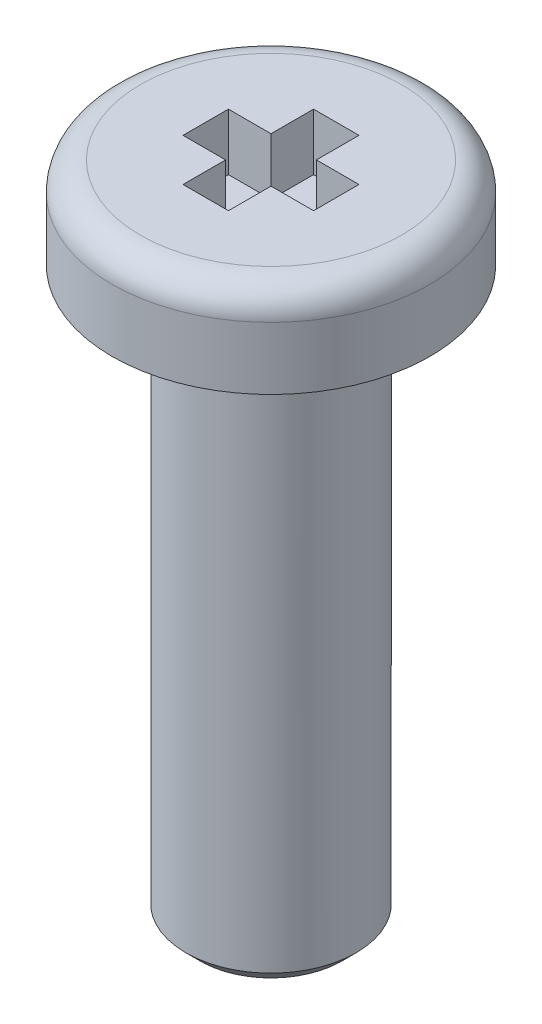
ISO-10303-21;
HEADER;
FILE_DESCRIPTION(('STEP AP214'),'2;1');
FILE_NAME('part.step','',(''),(''),'','','');
FILE_SCHEMA(('AUTOMOTIVE_DESIGN { 1 0 10303 214 1 1 1 1 }'));
ENDSEC;
DATA;
#1=APPLICATION_CONTEXT('core data for automotive mechanical design processes');
#2=APPLICATION_PROTOCOL_DEFINITION('international standard','automotive_design',2000,#1);
#3=PRODUCT_CONTEXT('',#1,'mechanical');
#4=PRODUCT('Part','Part','',(#3));
#5=PRODUCT_RELATED_PRODUCT_CATEGORY('part','',(#4));
#6=PRODUCT_DEFINITION_FORMATION('','',#4);
#7=PRODUCT_DEFINITION_CONTEXT('part definition',#1,'design');
#8=PRODUCT_DEFINITION('design','',#6,#7);
#9=PRODUCT_DEFINITION_SHAPE('','',#8);
#10=(LENGTH_UNIT() NAMED_UNIT(*) SI_UNIT(.MILLI.,.METRE.));
#11=(NAMED_UNIT(*) PLANE_ANGLE_UNIT() SI_UNIT($,.RADIAN.));
#12=(NAMED_UNIT(*) SI_UNIT($,.STERADIAN.) SOLID_ANGLE_UNIT());
#13=UNCERTAINTY_MEASURE_WITH_UNIT(LENGTH_MEASURE(1.E-05),#10,'distance_accuracy_value','');
#14=(GEOMETRIC_REPRESENTATION_CONTEXT(3) GLOBAL_UNCERTAINTY_ASSIGNED_CONTEXT((#13)) GLOBAL_UNIT_ASSIGNED_CONTEXT((#10,
#11,#12)) REPRESENTATION_CONTEXT('',''));
#15=CARTESIAN_POINT('',(0.,0.,0.));
#16=DIRECTION('',(0.,0.,1.));
#17=DIRECTION('',(1.,0.,0.));
#18=AXIS2_PLACEMENT_3D('',#15,#16,#17);
#19=CARTESIAN_POINT('',(2.8,0.,0.));
#20=DIRECTION('',(0.,1.,0.));
#21=DIRECTION('',(0.,0.,1.));
#22=AXIS2_PLACEMENT_3D('',#19,#20,#21);
#23=PLANE('',#22);
#24=CARTESIAN_POINT('',(0.,0.,0.));
#25=DIRECTION('',(0.,1.,0.));
#26=DIRECTION('',(0.,0.,1.));
#27=AXIS2_PLACEMENT_3D('',#24,#25,#26);
#28=CIRCLE('',#27,1.7);
#29=CARTESIAN_POINT('',(0.,0.,1.7));
#30=VERTEX_POINT('',#29);
#31=EDGE_CURVE('E209',#30,#30,#28,.T.);
#32=ORIENTED_EDGE('',*,*,#31,.T.);
#33=EDGE_LOOP('',(#32));
#34=FACE_BOUND('',#33,.T.);
#35=CARTESIAN_POINT('',(0.,0.,0.));
#36=DIRECTION('',(0.,1.,0.));
#37=DIRECTION('',(0.,0.,1.));
#38=AXIS2_PLACEMENT_3D('',#35,#36,#37);
#39=CIRCLE('',#38,2.8);
#40=CARTESIAN_POINT('',(0.,0.,2.8));
#41=VERTEX_POINT('',#40);
#42=EDGE_CURVE('E203',#41,#41,#39,.T.);
#43=ORIENTED_EDGE('',*,*,#42,.F.);
#44=EDGE_LOOP('',(#43));
#45=FACE_BOUND('',#44,.T.);
#46=ADVANCED_FACE('F31',(#34,#45),#23,.F.);
#47=CARTESIAN_POINT('',(0.4,0.6,1.15));
#48=DIRECTION('',(1.,0.,0.));
#49=DIRECTION('',(0.,0.,-1.));
#50=AXIS2_PLACEMENT_3D('',#47,#48,#49);
#51=PLANE('',#50);
#52=DIRECTION('',(0.,1.,0.));
#53=VECTOR('',#52,1.);
#54=CARTESIAN_POINT('',(0.4,0.6,0.399999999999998));
#55=LINE('',#54,#53);
#56=CARTESIAN_POINT('',(0.4,0.6,0.399999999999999));
#57=VERTEX_POINT('',#56);
#58=CARTESIAN_POINT('',(0.4,1.6,0.399999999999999));
#59=VERTEX_POINT('',#58);
#60=EDGE_CURVE('E153',#57,#59,#55,.T.);
#61=ORIENTED_EDGE('',*,*,#60,.F.);
#62=DIRECTION('',(0.,0.,-1.));
#63=VECTOR('',#62,1.);
#64=CARTESIAN_POINT('',(0.4,0.6,1.15));
#65=LINE('',#64,#63);
#66=CARTESIAN_POINT('',(0.4,0.6,1.15));
#67=VERTEX_POINT('',#66);
#68=EDGE_CURVE('E162',#67,#57,#65,.T.);
#69=ORIENTED_EDGE('',*,*,#68,.F.);
#70=DIRECTION('',(0.,1.,0.));
#71=VECTOR('',#70,1.);
#72=CARTESIAN_POINT('',(0.4,0.6,1.15));
#73=LINE('',#72,#71);
#74=CARTESIAN_POINT('',(0.4,1.6,1.15));
#75=VERTEX_POINT('',#74);
#76=EDGE_CURVE('E188',#67,#75,#73,.T.);
#77=ORIENTED_EDGE('',*,*,#76,.T.);
#78=DIRECTION('',(0.,0.,-1.));
#79=VECTOR('',#78,1.);
#80=CARTESIAN_POINT('',(0.4,1.6,1.15));
#81=LINE('',#80,#79);
#82=EDGE_CURVE('E175',#75,#59,#81,.T.);
#83=ORIENTED_EDGE('',*,*,#82,.T.);
#84=EDGE_LOOP('',(#61,#69,#77,#83));
#85=FACE_BOUND('',#84,.T.);
#86=ADVANCED_FACE('F225',(#85),#51,.F.);
#87=CARTESIAN_POINT('',(-0.4,0.6,1.15));
#88=DIRECTION('',(1.,0.,0.));
#89=DIRECTION('',(0.,0.,-1.));
#90=AXIS2_PLACEMENT_3D('',#87,#88,#89);
#91=PLANE('',#90);
#92=DIRECTION('',(0.,0.,-1.));
#93=VECTOR('',#92,1.);
#94=CARTESIAN_POINT('',(-0.4,0.6,1.15));
#95=LINE('',#94,#93);
#96=CARTESIAN_POINT('',(-0.4,0.6,1.15));
#97=VERTEX_POINT('',#96);
#98=CARTESIAN_POINT('',(-0.4,0.6,0.4));
#99=VERTEX_POINT('',#98);
#100=EDGE_CURVE('E169',#97,#99,#95,.T.);
#101=ORIENTED_EDGE('',*,*,#100,.T.);
#102=DIRECTION('',(0.,1.,0.));
#103=VECTOR('',#102,1.);
#104=CARTESIAN_POINT('',(-0.4,0.6,0.400000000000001));
#105=LINE('',#104,#103);
#106=CARTESIAN_POINT('',(-0.4,1.6,0.400000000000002));
#107=VERTEX_POINT('',#106);
#108=EDGE_CURVE('E150',#99,#107,#105,.T.);
#109=ORIENTED_EDGE('',*,*,#108,.T.);
#110=DIRECTION('',(0.,0.,-1.));
#111=VECTOR('',#110,1.);
#112=CARTESIAN_POINT('',(-0.4,1.6,1.15));
#113=LINE('',#112,#111);
#114=CARTESIAN_POINT('',(-0.4,1.6,1.15));
#115=VERTEX_POINT('',#114);
#116=EDGE_CURVE('E182',#115,#107,#113,.T.);
#117=ORIENTED_EDGE('',*,*,#116,.F.);
#118=DIRECTION('',(0.,1.,0.));
#119=VECTOR('',#118,1.);
#120=CARTESIAN_POINT('',(-0.4,0.6,1.15));
#121=LINE('',#120,#119);
#122=EDGE_CURVE('E191',#97,#115,#121,.T.);
#123=ORIENTED_EDGE('',*,*,#122,.F.);
#124=EDGE_LOOP('',(#101,#109,#117,#123));
#125=FACE_BOUND('',#124,.T.);
#126=ADVANCED_FACE('F231',(#125),#91,.T.);
#127=CARTESIAN_POINT('',(0.,11.592517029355,0.));
#128=DIRECTION('',(0.,1.,0.));
#129=DIRECTION('',(0.,0.,1.));
#130=AXIS2_PLACEMENT_3D('',#127,#128,#129);
#131=CYLINDRICAL_SURFACE('',#130,2.8);
#132=CARTESIAN_POINT('',(0.,1.1,0.));
#133=DIRECTION('',(0.,1.,0.));
#134=DIRECTION('',(0.,0.,1.));
#135=AXIS2_PLACEMENT_3D('',#132,#133,#134);
#136=CIRCLE('',#135,2.8);
#137=CARTESIAN_POINT('',(0.,1.1,2.8));
#138=VERTEX_POINT('',#137);
#139=EDGE_CURVE('E200',#138,#138,#136,.T.);
#140=ORIENTED_EDGE('',*,*,#139,.F.);
#141=EDGE_LOOP('',(#140));
#142=FACE_BOUND('',#141,.T.);
#143=ORIENTED_EDGE('',*,*,#42,.T.);
#144=EDGE_LOOP('',(#143));
#145=FACE_BOUND('',#144,.T.);
#146=ADVANCED_FACE('F237',(#142,#145),#131,.T.);
#147=CARTESIAN_POINT('',(0.,1.1,0.));
#148=DIRECTION('',(0.,1.,0.));
#149=DIRECTION('',(0.,0.,1.));
#150=AXIS2_PLACEMENT_3D('',#147,#148,#149);
#151=TOROIDAL_SURFACE('',#150,2.3,0.5);
#152=CARTESIAN_POINT('',(0.,1.6,0.));
#153=DIRECTION('',(0.,1.,0.));
#154=DIRECTION('',(0.,0.,1.));
#155=AXIS2_PLACEMENT_3D('',#152,#153,#154);
#156=CIRCLE('',#155,2.3);
#157=CARTESIAN_POINT('',(0.,1.6,2.3));
#158=VERTEX_POINT('',#157);
#159=EDGE_CURVE('E190',#158,#158,#156,.T.);
#160=ORIENTED_EDGE('',*,*,#159,.F.);
#161=EDGE_LOOP('',(#160));
#162=FACE_BOUND('',#161,.T.);
#163=ORIENTED_EDGE('',*,*,#139,.T.);
#164=EDGE_LOOP('',(#163));
#165=FACE_BOUND('',#164,.T.);
#166=ADVANCED_FACE('F240',(#162,#165),#151,.T.);
#167=CARTESIAN_POINT('',(0.,1.6,0.));
#168=DIRECTION('',(0.,-1.,0.));
#169=DIRECTION('',(0.,0.,-1.));
#170=AXIS2_PLACEMENT_3D('',#167,#168,#169);
#171=PLANE('',#170);
#172=CARTESIAN_POINT('',(0.4,1.6,-0.400000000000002));
#173=VERTEX_POINT('',#172);
#174=CARTESIAN_POINT('',(0.4,1.6,-1.15));
#175=VERTEX_POINT('',#174);
#176=EDGE_CURVE('E161',#173,#175,#81,.T.);
#177=ORIENTED_EDGE('',*,*,#176,.F.);
#178=DIRECTION('',(-1.,0.,0.));
#179=VECTOR('',#178,1.);
#180=CARTESIAN_POINT('',(1.15,1.6,-0.400000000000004));
#181=LINE('',#180,#179);
#182=CARTESIAN_POINT('',(1.15,1.6,-0.400000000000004));
#183=VERTEX_POINT('',#182);
#184=EDGE_CURVE('E438',#183,#173,#181,.T.);
#185=ORIENTED_EDGE('',*,*,#184,.F.);
#186=DIRECTION('',(0.,0.,1.));
#187=VECTOR('',#186,1.);
#188=CARTESIAN_POINT('',(1.15,1.6,-0.400000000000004));
#189=LINE('',#188,#187);
#190=CARTESIAN_POINT('',(1.15,1.6,0.399999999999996));
#191=VERTEX_POINT('',#190);
#192=EDGE_CURVE('E128',#183,#191,#189,.T.);
#193=ORIENTED_EDGE('',*,*,#192,.T.);
#194=DIRECTION('',(-1.,0.,0.));
#195=VECTOR('',#194,1.);
#196=CARTESIAN_POINT('',(1.15,1.6,0.399999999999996));
#197=LINE('',#196,#195);
#198=EDGE_CURVE('E423',#191,#59,#197,.T.);
#199=ORIENTED_EDGE('',*,*,#198,.T.);
#200=ORIENTED_EDGE('',*,*,#82,.F.);
#201=DIRECTION('',(-1.,0.,0.));
#202=VECTOR('',#201,1.);
#203=CARTESIAN_POINT('',(0.4,1.6,1.15));
#204=LINE('',#203,#202);
#205=EDGE_CURVE('E185',#75,#115,#204,.T.);
#206=ORIENTED_EDGE('',*,*,#205,.T.);
#207=ORIENTED_EDGE('',*,*,#116,.T.);
#208=CARTESIAN_POINT('',(-1.15,1.6,0.400000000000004));
#209=VERTEX_POINT('',#208);
#210=EDGE_CURVE('E429',#107,#209,#197,.T.);
#211=ORIENTED_EDGE('',*,*,#210,.T.);
#212=DIRECTION('',(0.,0.,-1.));
#213=VECTOR('',#212,1.);
#214=CARTESIAN_POINT('',(-1.15,1.6,0.400000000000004));
#215=LINE('',#214,#213);
#216=CARTESIAN_POINT('',(-1.15,1.6,-0.399999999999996));
#217=VERTEX_POINT('',#216);
#218=EDGE_CURVE('E433',#209,#217,#215,.T.);
#219=ORIENTED_EDGE('',*,*,#218,.T.);
#220=CARTESIAN_POINT('',(-0.4,1.6,-0.399999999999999));
#221=VERTEX_POINT('',#220);
#222=EDGE_CURVE('E141',#221,#217,#181,.T.);
#223=ORIENTED_EDGE('',*,*,#222,.F.);
#224=CARTESIAN_POINT('',(-0.4,1.6,-1.15));
#225=VERTEX_POINT('',#224);
#226=EDGE_CURVE('E181',#221,#225,#113,.T.);
#227=ORIENTED_EDGE('',*,*,#226,.T.);
#228=DIRECTION('',(1.,0.,0.));
#229=VECTOR('',#228,1.);
#230=CARTESIAN_POINT('',(-0.4,1.6,-1.15));
#231=LINE('',#230,#229);
#232=EDGE_CURVE('E178',#225,#175,#231,.T.);
#233=ORIENTED_EDGE('',*,*,#232,.T.);
#234=EDGE_LOOP('',(#177,#185,#193,#199,#200,#206,#207,#211,#219,#223,#227,#233));
#235=FACE_BOUND('',#234,.T.);
#236=ORIENTED_EDGE('',*,*,#159,.T.);
#237=EDGE_LOOP('',(#236));
#238=FACE_BOUND('',#237,.T.);
#239=ADVANCED_FACE('F244',(#235,#238),#171,.F.);
#240=CARTESIAN_POINT('',(0.4,0.6,-0.4));
#241=VERTEX_POINT('',#240);
#242=CARTESIAN_POINT('',(0.4,0.6,-1.15));
#243=VERTEX_POINT('',#242);
#244=EDGE_CURVE('E166',#241,#243,#65,.T.);
#245=ORIENTED_EDGE('',*,*,#244,.F.);
#246=DIRECTION('',(0.,1.,0.));
#247=VECTOR('',#246,1.);
#248=CARTESIAN_POINT('',(0.4,0.6,-0.400000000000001));
#249=LINE('',#248,#247);
#250=EDGE_CURVE('E158',#241,#173,#249,.T.);
#251=ORIENTED_EDGE('',*,*,#250,.T.);
#252=ORIENTED_EDGE('',*,*,#176,.T.);
#253=DIRECTION('',(0.,1.,0.));
#254=VECTOR('',#253,1.);
#255=CARTESIAN_POINT('',(0.4,0.6,-1.15));
#256=LINE('',#255,#254);
#257=EDGE_CURVE('E174',#243,#175,#256,.T.);
#258=ORIENTED_EDGE('',*,*,#257,.F.);
#259=EDGE_LOOP('',(#245,#251,#252,#258));
#260=FACE_BOUND('',#259,.T.);
#261=ADVANCED_FACE('F234',(#260),#51,.F.);
#262=CARTESIAN_POINT('',(0.4,0.6,1.15));
#263=DIRECTION('',(0.,0.,-1.));
#264=DIRECTION('',(-1.,0.,0.));
#265=AXIS2_PLACEMENT_3D('',#262,#263,#264);
#266=PLANE('',#265);
#267=ORIENTED_EDGE('',*,*,#205,.F.);
#268=ORIENTED_EDGE('',*,*,#76,.F.);
#269=DIRECTION('',(-1.,0.,0.));
#270=VECTOR('',#269,1.);
#271=CARTESIAN_POINT('',(0.4,0.6,1.15));
#272=LINE('',#271,#270);
#273=EDGE_CURVE('E172',#67,#97,#272,.T.);
#274=ORIENTED_EDGE('',*,*,#273,.T.);
#275=ORIENTED_EDGE('',*,*,#122,.T.);
#276=EDGE_LOOP('',(#267,#268,#274,#275));
#277=FACE_BOUND('',#276,.T.);
#278=ADVANCED_FACE('F250',(#277),#266,.T.);
#279=DIRECTION('',(0.,1.,0.));
#280=VECTOR('',#279,1.);
#281=CARTESIAN_POINT('',(-0.4,0.6,-0.399999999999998));
#282=LINE('',#281,#280);
#283=CARTESIAN_POINT('',(-0.4,0.6,-0.399999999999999));
#284=VERTEX_POINT('',#283);
#285=EDGE_CURVE('E156',#284,#221,#282,.T.);
#286=ORIENTED_EDGE('',*,*,#285,.F.);
#287=CARTESIAN_POINT('',(-0.4,0.6,-1.15));
#288=VERTEX_POINT('',#287);
#289=EDGE_CURVE('E124',#284,#288,#95,.T.);
#290=ORIENTED_EDGE('',*,*,#289,.T.);
#291=DIRECTION('',(0.,1.,0.));
#292=VECTOR('',#291,1.);
#293=CARTESIAN_POINT('',(-0.4,0.6,-1.15));
#294=LINE('',#293,#292);
#295=EDGE_CURVE('E193',#288,#225,#294,.T.);
#296=ORIENTED_EDGE('',*,*,#295,.T.);
#297=ORIENTED_EDGE('',*,*,#226,.F.);
#298=EDGE_LOOP('',(#286,#290,#296,#297));
#299=FACE_BOUND('',#298,.T.);
#300=ADVANCED_FACE('F255',(#299),#91,.T.);
#301=CARTESIAN_POINT('',(-0.4,0.6,-1.15));
#302=DIRECTION('',(0.,0.,1.));
#303=DIRECTION('',(1.,0.,0.));
#304=AXIS2_PLACEMENT_3D('',#301,#302,#303);
#305=PLANE('',#304);
#306=ORIENTED_EDGE('',*,*,#232,.F.);
#307=ORIENTED_EDGE('',*,*,#295,.F.);
#308=DIRECTION('',(1.,0.,0.));
#309=VECTOR('',#308,1.);
#310=CARTESIAN_POINT('',(-0.4,0.6,-1.15));
#311=LINE('',#310,#309);
#312=EDGE_CURVE('E165',#288,#243,#311,.T.);
#313=ORIENTED_EDGE('',*,*,#312,.T.);
#314=ORIENTED_EDGE('',*,*,#257,.T.);
#315=EDGE_LOOP('',(#306,#307,#313,#314));
#316=FACE_BOUND('',#315,.T.);
#317=ADVANCED_FACE('F252',(#316),#305,.T.);
#318=CARTESIAN_POINT('',(0.4,0.6,-1.15));
#319=DIRECTION('',(0.,-1.,0.));
#320=DIRECTION('',(0.,0.,-1.));
#321=AXIS2_PLACEMENT_3D('',#318,#319,#320);
#322=PLANE('',#321);
#323=ORIENTED_EDGE('',*,*,#289,.F.);
#324=DIRECTION('',(-1.,0.,0.));
#325=VECTOR('',#324,1.);
#326=CARTESIAN_POINT('',(1.15,0.6,-0.400000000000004));
#327=LINE('',#326,#325);
#328=CARTESIAN_POINT('',(-1.15,0.6,-0.399999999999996));
#329=VERTEX_POINT('',#328);
#330=EDGE_CURVE('E119',#284,#329,#327,.T.);
#331=ORIENTED_EDGE('',*,*,#330,.T.);
#332=DIRECTION('',(0.,0.,-1.));
#333=VECTOR('',#332,1.);
#334=CARTESIAN_POINT('',(-1.15,0.6,0.400000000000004));
#335=LINE('',#334,#333);
#336=CARTESIAN_POINT('',(-1.15,0.6,0.400000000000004));
#337=VERTEX_POINT('',#336);
#338=EDGE_CURVE('E122',#337,#329,#335,.T.);
#339=ORIENTED_EDGE('',*,*,#338,.F.);
#340=DIRECTION('',(-1.,0.,0.));
#341=VECTOR('',#340,1.);
#342=CARTESIAN_POINT('',(1.15,0.6,0.399999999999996));
#343=LINE('',#342,#341);
#344=EDGE_CURVE('E46',#99,#337,#343,.T.);
#345=ORIENTED_EDGE('',*,*,#344,.F.);
#346=ORIENTED_EDGE('',*,*,#100,.F.);
#347=ORIENTED_EDGE('',*,*,#273,.F.);
#348=ORIENTED_EDGE('',*,*,#68,.T.);
#349=CARTESIAN_POINT('',(1.15,0.6,0.399999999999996));
#350=VERTEX_POINT('',#349);
#351=EDGE_CURVE('E146',#350,#57,#343,.T.);
#352=ORIENTED_EDGE('',*,*,#351,.F.);
#353=DIRECTION('',(0.,0.,1.));
#354=VECTOR('',#353,1.);
#355=CARTESIAN_POINT('',(1.15,0.6,-0.400000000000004));
#356=LINE('',#355,#354);
#357=CARTESIAN_POINT('',(1.15,0.6,-0.400000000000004));
#358=VERTEX_POINT('',#357);
#359=EDGE_CURVE('E142',#358,#350,#356,.T.);
#360=ORIENTED_EDGE('',*,*,#359,.F.);
#361=EDGE_CURVE('E53',#358,#241,#327,.T.);
#362=ORIENTED_EDGE('',*,*,#361,.T.);
#363=ORIENTED_EDGE('',*,*,#244,.T.);
#364=ORIENTED_EDGE('',*,*,#312,.F.);
#365=EDGE_LOOP('',(#323,#331,#339,#345,#346,#347,#348,#352,#360,#362,#363,#364));
#366=FACE_BOUND('',#365,.T.);
#367=ADVANCED_FACE('F121',(#366),#322,.F.);
#368=CARTESIAN_POINT('',(1.15,0.6,0.399999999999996));
#369=DIRECTION('',(0.,0.,-1.));
#370=DIRECTION('',(-1.,0.,0.));
#371=AXIS2_PLACEMENT_3D('',#368,#369,#370);
#372=PLANE('',#371);
#373=ORIENTED_EDGE('',*,*,#344,.T.);
#374=DIRECTION('',(0.,1.,0.));
#375=VECTOR('',#374,1.);
#376=CARTESIAN_POINT('',(-1.15,0.6,0.400000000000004));
#377=LINE('',#376,#375);
#378=EDGE_CURVE('E137',#337,#209,#377,.T.);
#379=ORIENTED_EDGE('',*,*,#378,.T.);
#380=ORIENTED_EDGE('',*,*,#210,.F.);
#381=ORIENTED_EDGE('',*,*,#108,.F.);
#382=EDGE_LOOP('',(#373,#379,#380,#381));
#383=FACE_BOUND('',#382,.T.);
#384=ADVANCED_FACE('F265',(#383),#372,.T.);
#385=CARTESIAN_POINT('',(1.15,0.6,-0.400000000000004));
#386=DIRECTION('',(0.,0.,-1.));
#387=DIRECTION('',(-1.,0.,0.));
#388=AXIS2_PLACEMENT_3D('',#385,#386,#387);
#389=PLANE('',#388);
#390=ORIENTED_EDGE('',*,*,#285,.T.);
#391=ORIENTED_EDGE('',*,*,#222,.T.);
#392=DIRECTION('',(0.,1.,0.));
#393=VECTOR('',#392,1.);
#394=CARTESIAN_POINT('',(-1.15,0.6,-0.399999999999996));
#395=LINE('',#394,#393);
#396=EDGE_CURVE('E135',#329,#217,#395,.T.);
#397=ORIENTED_EDGE('',*,*,#396,.F.);
#398=ORIENTED_EDGE('',*,*,#330,.F.);
#399=EDGE_LOOP('',(#390,#391,#397,#398));
#400=FACE_BOUND('',#399,.T.);
#401=ADVANCED_FACE('F139',(#400),#389,.F.);
#402=CARTESIAN_POINT('',(-1.15,0.6,0.400000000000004));
#403=DIRECTION('',(1.,0.,0.));
#404=DIRECTION('',(0.,0.,-1.));
#405=AXIS2_PLACEMENT_3D('',#402,#403,#404);
#406=PLANE('',#405);
#407=ORIENTED_EDGE('',*,*,#218,.F.);
#408=ORIENTED_EDGE('',*,*,#378,.F.);
#409=ORIENTED_EDGE('',*,*,#338,.T.);
#410=ORIENTED_EDGE('',*,*,#396,.T.);
#411=EDGE_LOOP('',(#407,#408,#409,#410));
#412=FACE_BOUND('',#411,.T.);
#413=ADVANCED_FACE('F134',(#412),#406,.T.);
#414=ORIENTED_EDGE('',*,*,#361,.F.);
#415=DIRECTION('',(0.,1.,0.));
#416=VECTOR('',#415,1.);
#417=CARTESIAN_POINT('',(1.15,0.6,-0.400000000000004));
#418=LINE('',#417,#416);
#419=EDGE_CURVE('E154',#358,#183,#418,.T.);
#420=ORIENTED_EDGE('',*,*,#419,.T.);
#421=ORIENTED_EDGE('',*,*,#184,.T.);
#422=ORIENTED_EDGE('',*,*,#250,.F.);
#423=EDGE_LOOP('',(#414,#420,#421,#422));
#424=FACE_BOUND('',#423,.T.);
#425=ADVANCED_FACE('F268',(#424),#389,.F.);
#426=ORIENTED_EDGE('',*,*,#60,.T.);
#427=ORIENTED_EDGE('',*,*,#198,.F.);
#428=DIRECTION('',(0.,1.,0.));
#429=VECTOR('',#428,1.);
#430=CARTESIAN_POINT('',(1.15,0.6,0.399999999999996));
#431=LINE('',#430,#429);
#432=EDGE_CURVE('E144',#350,#191,#431,.T.);
#433=ORIENTED_EDGE('',*,*,#432,.F.);
#434=ORIENTED_EDGE('',*,*,#351,.T.);
#435=EDGE_LOOP('',(#426,#427,#433,#434));
#436=FACE_BOUND('',#435,.T.);
#437=ADVANCED_FACE('F274',(#436),#372,.T.);
#438=CARTESIAN_POINT('',(1.15,0.6,-0.400000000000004));
#439=DIRECTION('',(-1.,0.,0.));
#440=DIRECTION('',(0.,0.,1.));
#441=AXIS2_PLACEMENT_3D('',#438,#439,#440);
#442=PLANE('',#441);
#443=ORIENTED_EDGE('',*,*,#192,.F.);
#444=ORIENTED_EDGE('',*,*,#419,.F.);
#445=ORIENTED_EDGE('',*,*,#359,.T.);
#446=ORIENTED_EDGE('',*,*,#432,.T.);
#447=EDGE_LOOP('',(#443,#444,#445,#446));
#448=FACE_BOUND('',#447,.T.);
#449=ADVANCED_FACE('F275',(#448),#442,.T.);
#450=CARTESIAN_POINT('',(0.,-10.,0.));
#451=DIRECTION('',(0.,1.,0.));
#452=DIRECTION('',(0.,0.,1.));
#453=AXIS2_PLACEMENT_3D('',#450,#451,#452);
#454=CYLINDRICAL_SURFACE('',#453,1.5);
#455=CARTESIAN_POINT('',(0.,-9.75,0.));
#456=DIRECTION('',(0.,-1.,0.));
#457=DIRECTION('',(0.,0.,-1.));
#458=AXIS2_PLACEMENT_3D('',#455,#456,#457);
#459=CIRCLE('',#458,1.5);
#460=CARTESIAN_POINT('',(0.,-9.75,-1.5));
#461=VERTEX_POINT('',#460);
#462=EDGE_CURVE('E11',#461,#461,#459,.F.);
#463=ORIENTED_EDGE('',*,*,#462,.T.);
#464=EDGE_LOOP('',(#463));
#465=FACE_BOUND('',#464,.T.);
#466=CARTESIAN_POINT('',(0.,-0.200000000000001,0.));
#467=DIRECTION('',(0.,1.,0.));
#468=DIRECTION('',(0.,0.,1.));
#469=AXIS2_PLACEMENT_3D('',#466,#467,#468);
#470=CIRCLE('',#469,1.5);
#471=CARTESIAN_POINT('',(0.,-0.200000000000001,1.5));
#472=VERTEX_POINT('',#471);
#473=EDGE_CURVE('E206',#472,#472,#470,.F.);
#474=ORIENTED_EDGE('',*,*,#473,.T.);
#475=EDGE_LOOP('',(#474));
#476=FACE_BOUND('',#475,.T.);
#477=ADVANCED_FACE('F278',(#465,#476),#454,.T.);
#478=CARTESIAN_POINT('',(0.,-10.,0.));
#479=DIRECTION('',(0.,-1.,0.));
#480=DIRECTION('',(0.,0.,-1.));
#481=AXIS2_PLACEMENT_3D('',#478,#479,#480);
#482=PLANE('',#481);
#483=CARTESIAN_POINT('',(0.,-10.,0.));
#484=DIRECTION('',(0.,-1.,0.));
#485=DIRECTION('',(0.,0.,-1.));
#486=AXIS2_PLACEMENT_3D('',#483,#484,#485);
#487=CIRCLE('',#486,1.25);
#488=CARTESIAN_POINT('',(0.,-10.,-1.25));
#489=VERTEX_POINT('',#488);
#490=EDGE_CURVE('E39',#489,#489,#487,.T.);
#491=ORIENTED_EDGE('',*,*,#490,.T.);
#492=EDGE_LOOP('',(#491));
#493=FACE_BOUND('',#492,.T.);
#494=ADVANCED_FACE('F214',(#493),#482,.T.);
#495=CARTESIAN_POINT('',(0.,-0.200000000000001,0.));
#496=DIRECTION('',(0.,1.,0.));
#497=DIRECTION('',(0.,0.,1.));
#498=AXIS2_PLACEMENT_3D('',#495,#496,#497);
#499=TOROIDAL_SURFACE('',#498,1.7,0.2);
#500=ORIENTED_EDGE('',*,*,#31,.F.);
#501=EDGE_LOOP('',(#500));
#502=FACE_BOUND('',#501,.T.);
#503=ORIENTED_EDGE('',*,*,#473,.F.);
#504=EDGE_LOOP('',(#503));
#505=FACE_BOUND('',#504,.T.);
#506=ADVANCED_FACE('F217',(#502,#505),#499,.F.);
#507=CARTESIAN_POINT('',(0.,-10.,0.));
#508=DIRECTION('',(0.,1.,0.));
#509=DIRECTION('',(0.,0.,1.));
#510=AXIS2_PLACEMENT_3D('',#507,#508,#509);
#511=CONICAL_SURFACE('',#510,1.25,0.785398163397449);
#512=ORIENTED_EDGE('',*,*,#462,.F.);
#513=EDGE_LOOP('',(#512));
#514=FACE_BOUND('',#513,.T.);
#515=ORIENTED_EDGE('',*,*,#490,.F.);
#516=EDGE_LOOP('',(#515));
#517=FACE_BOUND('',#516,.T.);
#518=ADVANCED_FACE('F33',(#514,#517),#511,.T.);
#519=CLOSED_SHELL('',(#46,#86,#126,#146,#166,#239,#261,#278,#300,#317,#367,#384,#401,#413,#425,
#437,#449,#477,#494,#506,#518));
#520=MANIFOLD_SOLID_BREP('B2',#519);
#521=ADVANCED_BREP_SHAPE_REPRESENTATION('',(#18,#520),#14);
#522=SHAPE_DEFINITION_REPRESENTATION(#9,#521);
ENDSEC;
END-ISO-10303-21;
